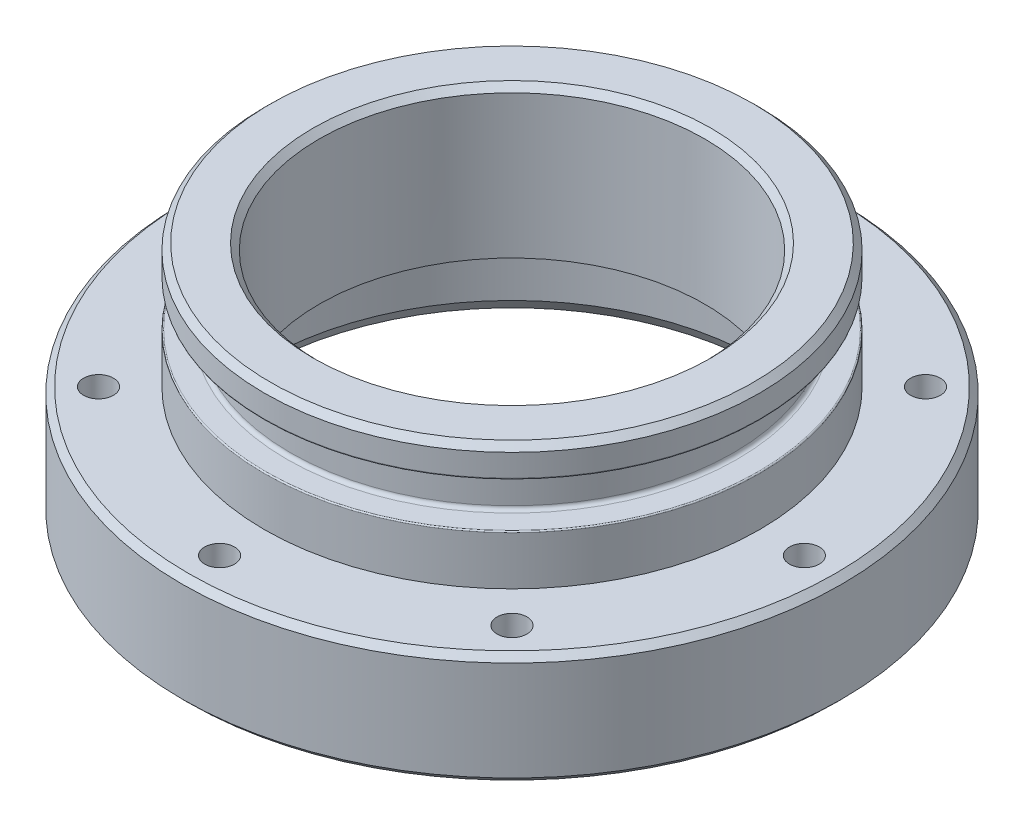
ISO-10303-21;
HEADER;
FILE_DESCRIPTION(('STEP AP214'),'2;1');
FILE_NAME('part.step','',(''),(''),'','','');
FILE_SCHEMA(('AUTOMOTIVE_DESIGN { 1 0 10303 214 1 1 1 1 }'));
ENDSEC;
DATA;
#1=APPLICATION_CONTEXT('core data for automotive mechanical design processes');
#2=APPLICATION_PROTOCOL_DEFINITION('international standard','automotive_design',2000,#1);
#3=PRODUCT_CONTEXT('',#1,'mechanical');
#4=PRODUCT('Part','Part','',(#3));
#5=PRODUCT_RELATED_PRODUCT_CATEGORY('part','',(#4));
#6=PRODUCT_DEFINITION_FORMATION('','',#4);
#7=PRODUCT_DEFINITION_CONTEXT('part definition',#1,'design');
#8=PRODUCT_DEFINITION('design','',#6,#7);
#9=PRODUCT_DEFINITION_SHAPE('','',#8);
#10=(LENGTH_UNIT() NAMED_UNIT(*) SI_UNIT(.MILLI.,.METRE.));
#11=(NAMED_UNIT(*) PLANE_ANGLE_UNIT() SI_UNIT($,.RADIAN.));
#12=(NAMED_UNIT(*) SI_UNIT($,.STERADIAN.) SOLID_ANGLE_UNIT());
#13=UNCERTAINTY_MEASURE_WITH_UNIT(LENGTH_MEASURE(1.E-05),#10,'distance_accuracy_value','');
#14=(GEOMETRIC_REPRESENTATION_CONTEXT(3) GLOBAL_UNCERTAINTY_ASSIGNED_CONTEXT((#13)) GLOBAL_UNIT_ASSIGNED_CONTEXT((#10,
#11,#12)) REPRESENTATION_CONTEXT('',''));
#15=CARTESIAN_POINT('',(0.,0.,0.));
#16=DIRECTION('',(0.,0.,1.));
#17=DIRECTION('',(1.,0.,0.));
#18=AXIS2_PLACEMENT_3D('',#15,#16,#17);
#19=CARTESIAN_POINT('',(20.5,0.,0.));
#20=DIRECTION('',(0.,1.,0.));
#21=DIRECTION('',(0.,0.,1.));
#22=AXIS2_PLACEMENT_3D('',#19,#20,#21);
#23=PLANE('',#22);
#24=CARTESIAN_POINT('',(-16.6170093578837,0.,16.6170093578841));
#25=DIRECTION('',(0.,-1.,0.));
#26=DIRECTION('',(0.,0.,-1.));
#27=AXIS2_PLACEMENT_3D('',#24,#25,#26);
#28=CIRCLE('',#27,2.19999999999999);
#29=CARTESIAN_POINT('',(-16.6170093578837,0.,14.4170093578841));
#30=VERTEX_POINT('',#29);
#31=EDGE_CURVE('E201',#30,#30,#28,.T.);
#32=ORIENTED_EDGE('',*,*,#31,.F.);
#33=EDGE_LOOP('',(#32));
#34=FACE_BOUND('',#33,.T.);
#35=CARTESIAN_POINT('',(-23.5,0.,2.46149434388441E-13));
#36=DIRECTION('',(0.,-1.,0.));
#37=DIRECTION('',(0.,0.,-1.));
#38=AXIS2_PLACEMENT_3D('',#35,#36,#37);
#39=CIRCLE('',#38,2.19999999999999);
#40=CARTESIAN_POINT('',(-23.5,0.,-2.19999999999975));
#41=VERTEX_POINT('',#40);
#42=EDGE_CURVE('E64',#41,#41,#39,.T.);
#43=ORIENTED_EDGE('',*,*,#42,.F.);
#44=EDGE_LOOP('',(#43));
#45=FACE_BOUND('',#44,.T.);
#46=CARTESIAN_POINT('',(-16.617009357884,0.,-16.6170093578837));
#47=DIRECTION('',(0.,-1.,0.));
#48=DIRECTION('',(0.,0.,-1.));
#49=AXIS2_PLACEMENT_3D('',#46,#47,#48);
#50=CIRCLE('',#49,2.19999999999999);
#51=CARTESIAN_POINT('',(-16.617009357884,0.,-18.8170093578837));
#52=VERTEX_POINT('',#51);
#53=EDGE_CURVE('E69',#52,#52,#50,.T.);
#54=ORIENTED_EDGE('',*,*,#53,.F.);
#55=EDGE_LOOP('',(#54));
#56=FACE_BOUND('',#55,.T.);
#57=CARTESIAN_POINT('',(0.,0.,-23.5));
#58=DIRECTION('',(0.,-1.,0.));
#59=DIRECTION('',(0.,0.,-1.));
#60=AXIS2_PLACEMENT_3D('',#57,#58,#59);
#61=CIRCLE('',#60,2.19999999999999);
#62=CARTESIAN_POINT('',(0.,0.,-25.7));
#63=VERTEX_POINT('',#62);
#64=EDGE_CURVE('E74',#63,#63,#61,.T.);
#65=ORIENTED_EDGE('',*,*,#64,.F.);
#66=EDGE_LOOP('',(#65));
#67=FACE_BOUND('',#66,.T.);
#68=CARTESIAN_POINT('',(16.6170093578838,0.,-16.617009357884));
#69=DIRECTION('',(0.,-1.,0.));
#70=DIRECTION('',(0.,0.,-1.));
#71=AXIS2_PLACEMENT_3D('',#68,#69,#70);
#72=CIRCLE('',#71,2.19999999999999);
#73=CARTESIAN_POINT('',(16.6170093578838,0.,-18.8170093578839));
#74=VERTEX_POINT('',#73);
#75=EDGE_CURVE('E79',#74,#74,#72,.T.);
#76=ORIENTED_EDGE('',*,*,#75,.F.);
#77=EDGE_LOOP('',(#76));
#78=FACE_BOUND('',#77,.T.);
#79=CARTESIAN_POINT('',(0.,0.,0.));
#80=DIRECTION('',(0.,1.,0.));
#81=DIRECTION('',(0.,0.,1.));
#82=AXIS2_PLACEMENT_3D('',#79,#80,#81);
#83=CIRCLE('',#82,20.5);
#84=CARTESIAN_POINT('',(0.,0.,20.5));
#85=VERTEX_POINT('',#84);
#86=EDGE_CURVE('E130',#85,#85,#83,.T.);
#87=ORIENTED_EDGE('',*,*,#86,.T.);
#88=EDGE_LOOP('',(#87));
#89=FACE_BOUND('',#88,.T.);
#90=CARTESIAN_POINT('',(0.,0.,23.5));
#91=DIRECTION('',(0.,-1.,0.));
#92=DIRECTION('',(0.,0.,-1.));
#93=AXIS2_PLACEMENT_3D('',#90,#91,#92);
#94=CIRCLE('',#93,2.19999999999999);
#95=CARTESIAN_POINT('',(0.,0.,21.3));
#96=VERTEX_POINT('',#95);
#97=EDGE_CURVE('E94',#96,#96,#94,.T.);
#98=ORIENTED_EDGE('',*,*,#97,.F.);
#99=EDGE_LOOP('',(#98));
#100=FACE_BOUND('',#99,.T.);
#101=CARTESIAN_POINT('',(0.,0.,0.));
#102=DIRECTION('',(0.,1.,0.));
#103=DIRECTION('',(0.,0.,1.));
#104=AXIS2_PLACEMENT_3D('',#101,#102,#103);
#105=CIRCLE('',#104,26.);
#106=CARTESIAN_POINT('',(0.,0.,26.));
#107=VERTEX_POINT('',#106);
#108=EDGE_CURVE('E60',#107,#107,#105,.F.);
#109=ORIENTED_EDGE('',*,*,#108,.T.);
#110=EDGE_LOOP('',(#109));
#111=FACE_BOUND('',#110,.T.);
#112=CARTESIAN_POINT('',(16.6170093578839,0.,16.6170093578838));
#113=DIRECTION('',(0.,-1.,0.));
#114=DIRECTION('',(0.,0.,-1.));
#115=AXIS2_PLACEMENT_3D('',#112,#113,#114);
#116=CIRCLE('',#115,2.19999999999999);
#117=CARTESIAN_POINT('',(16.6170093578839,0.,14.4170093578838));
#118=VERTEX_POINT('',#117);
#119=EDGE_CURVE('E89',#118,#118,#116,.T.);
#120=ORIENTED_EDGE('',*,*,#119,.F.);
#121=EDGE_LOOP('',(#120));
#122=FACE_BOUND('',#121,.T.);
#123=CARTESIAN_POINT('',(23.5,0.,0.));
#124=DIRECTION('',(0.,-1.,0.));
#125=DIRECTION('',(0.,0.,-1.));
#126=AXIS2_PLACEMENT_3D('',#123,#124,#125);
#127=CIRCLE('',#126,2.19999999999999);
#128=CARTESIAN_POINT('',(23.5,0.,-2.20000000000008));
#129=VERTEX_POINT('',#128);
#130=EDGE_CURVE('E84',#129,#129,#127,.T.);
#131=ORIENTED_EDGE('',*,*,#130,.F.);
#132=EDGE_LOOP('',(#131));
#133=FACE_BOUND('',#132,.T.);
#134=ADVANCED_FACE('F34',(#34,#45,#56,#67,#78,#89,#100,#111,#122,#133),#23,.F.);
#135=CARTESIAN_POINT('',(19.9,19.,0.));
#136=DIRECTION('',(0.,-1.,0.));
#137=DIRECTION('',(0.,0.,-1.));
#138=AXIS2_PLACEMENT_3D('',#135,#136,#137);
#139=PLANE('',#138);
#140=CARTESIAN_POINT('',(0.,19.,0.));
#141=DIRECTION('',(0.,-1.,0.));
#142=DIRECTION('',(0.,0.,-1.));
#143=AXIS2_PLACEMENT_3D('',#140,#141,#142);
#144=CIRCLE('',#143,16.);
#145=CARTESIAN_POINT('',(0.,19.,-16.));
#146=VERTEX_POINT('',#145);
#147=EDGE_CURVE('E110',#146,#146,#144,.T.);
#148=ORIENTED_EDGE('',*,*,#147,.T.);
#149=EDGE_LOOP('',(#148));
#150=FACE_BOUND('',#149,.T.);
#151=CARTESIAN_POINT('',(0.,19.,0.));
#152=DIRECTION('',(0.,-1.,0.));
#153=DIRECTION('',(0.,0.,-1.));
#154=AXIS2_PLACEMENT_3D('',#151,#152,#153);
#155=CIRCLE('',#154,19.4);
#156=CARTESIAN_POINT('',(0.,19.,-19.4));
#157=VERTEX_POINT('',#156);
#158=EDGE_CURVE('E113',#157,#157,#155,.F.);
#159=ORIENTED_EDGE('',*,*,#158,.T.);
#160=EDGE_LOOP('',(#159));
#161=FACE_BOUND('',#160,.T.);
#162=ADVANCED_FACE('F209',(#150,#161),#139,.F.);
#163=CARTESIAN_POINT('',(0.,15.0015133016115,0.));
#164=DIRECTION('',(0.,1.,0.));
#165=DIRECTION('',(0.,0.,1.));
#166=AXIS2_PLACEMENT_3D('',#163,#164,#165);
#167=CYLINDRICAL_SURFACE('',#166,15.5);
#168=CARTESIAN_POINT('',(0.,18.5,0.));
#169=DIRECTION('',(0.,-1.,0.));
#170=DIRECTION('',(0.,0.,-1.));
#171=AXIS2_PLACEMENT_3D('',#168,#169,#170);
#172=CIRCLE('',#171,15.5);
#173=CARTESIAN_POINT('',(0.,18.5,-15.5));
#174=VERTEX_POINT('',#173);
#175=EDGE_CURVE('E116',#174,#174,#172,.F.);
#176=ORIENTED_EDGE('',*,*,#175,.T.);
#177=EDGE_LOOP('',(#176));
#178=FACE_BOUND('',#177,.T.);
#179=CARTESIAN_POINT('',(0.,7.00000000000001,0.));
#180=DIRECTION('',(0.,1.,0.));
#181=DIRECTION('',(0.,0.,1.));
#182=AXIS2_PLACEMENT_3D('',#179,#180,#181);
#183=CIRCLE('',#182,15.5);
#184=CARTESIAN_POINT('',(0.,7.00000000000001,15.5));
#185=VERTEX_POINT('',#184);
#186=EDGE_CURVE('E119',#185,#185,#183,.T.);
#187=ORIENTED_EDGE('',*,*,#186,.F.);
#188=EDGE_LOOP('',(#187));
#189=FACE_BOUND('',#188,.T.);
#190=ADVANCED_FACE('F323',(#178,#189),#167,.F.);
#191=CARTESIAN_POINT('',(15.5,7.00000000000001,0.));
#192=DIRECTION('',(0.,1.,0.));
#193=DIRECTION('',(0.,0.,1.));
#194=AXIS2_PLACEMENT_3D('',#191,#192,#193);
#195=PLANE('',#194);
#196=CARTESIAN_POINT('',(0.,7.00000000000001,0.));
#197=DIRECTION('',(0.,1.,0.));
#198=DIRECTION('',(0.,0.,1.));
#199=AXIS2_PLACEMENT_3D('',#196,#197,#198);
#200=CIRCLE('',#199,19.7);
#201=CARTESIAN_POINT('',(0.,7.00000000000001,19.7));
#202=VERTEX_POINT('',#201);
#203=EDGE_CURVE('E10',#202,#202,#200,.F.);
#204=ORIENTED_EDGE('',*,*,#203,.T.);
#205=EDGE_LOOP('',(#204));
#206=FACE_BOUND('',#205,.T.);
#207=ORIENTED_EDGE('',*,*,#186,.T.);
#208=EDGE_LOOP('',(#207));
#209=FACE_BOUND('',#208,.T.);
#210=ADVANCED_FACE('F320',(#206,#209),#195,.F.);
#211=CARTESIAN_POINT('',(0.,15.0015133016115,0.));
#212=DIRECTION('',(0.,1.,0.));
#213=DIRECTION('',(0.,0.,1.));
#214=AXIS2_PLACEMENT_3D('',#211,#212,#213);
#215=CYLINDRICAL_SURFACE('',#214,20.);
#216=CARTESIAN_POINT('',(0.,6.70000000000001,0.));
#217=DIRECTION('',(0.,1.,0.));
#218=DIRECTION('',(0.,0.,1.));
#219=AXIS2_PLACEMENT_3D('',#216,#217,#218);
#220=CIRCLE('',#219,20.);
#221=CARTESIAN_POINT('',(0.,6.70000000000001,20.));
#222=VERTEX_POINT('',#221);
#223=EDGE_CURVE('E41',#222,#222,#220,.T.);
#224=ORIENTED_EDGE('',*,*,#223,.T.);
#225=EDGE_LOOP('',(#224));
#226=FACE_BOUND('',#225,.T.);
#227=CARTESIAN_POINT('',(0.,0.866025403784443,0.));
#228=DIRECTION('',(0.,1.,0.));
#229=DIRECTION('',(0.,0.,1.));
#230=AXIS2_PLACEMENT_3D('',#227,#228,#229);
#231=CIRCLE('',#230,20.);
#232=CARTESIAN_POINT('',(0.,0.866025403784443,20.));
#233=VERTEX_POINT('',#232);
#234=EDGE_CURVE('E127',#233,#233,#231,.T.);
#235=ORIENTED_EDGE('',*,*,#234,.F.);
#236=EDGE_LOOP('',(#235));
#237=FACE_BOUND('',#236,.T.);
#238=ADVANCED_FACE('F316',(#226,#237),#215,.F.);
#239=CARTESIAN_POINT('',(0.,0.866025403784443,0.));
#240=DIRECTION('',(0.,-1.,0.));
#241=DIRECTION('',(0.,0.,-1.));
#242=AXIS2_PLACEMENT_3D('',#239,#240,#241);
#243=CONICAL_SURFACE('',#242,20.,0.523598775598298);
#244=ORIENTED_EDGE('',*,*,#86,.F.);
#245=EDGE_LOOP('',(#244));
#246=FACE_BOUND('',#245,.T.);
#247=ORIENTED_EDGE('',*,*,#234,.T.);
#248=EDGE_LOOP('',(#247));
#249=FACE_BOUND('',#248,.T.);
#250=ADVANCED_FACE('F311',(#246,#249),#243,.F.);
#251=CARTESIAN_POINT('',(0.,15.0015133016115,0.));
#252=DIRECTION('',(0.,1.,0.));
#253=DIRECTION('',(0.,0.,1.));
#254=AXIS2_PLACEMENT_3D('',#251,#252,#253);
#255=CYLINDRICAL_SURFACE('',#254,26.5);
#256=CARTESIAN_POINT('',(0.,8.50000000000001,0.));
#257=DIRECTION('',(0.,-1.,0.));
#258=DIRECTION('',(0.,0.,-1.));
#259=AXIS2_PLACEMENT_3D('',#256,#257,#258);
#260=CIRCLE('',#259,26.5);
#261=CARTESIAN_POINT('',(0.,8.50000000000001,-26.5));
#262=VERTEX_POINT('',#261);
#263=EDGE_CURVE('E98',#262,#262,#260,.T.);
#264=ORIENTED_EDGE('',*,*,#263,.T.);
#265=EDGE_LOOP('',(#264));
#266=FACE_BOUND('',#265,.T.);
#267=CARTESIAN_POINT('',(0.,0.499999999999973,0.));
#268=DIRECTION('',(0.,1.,0.));
#269=DIRECTION('',(0.,0.,1.));
#270=AXIS2_PLACEMENT_3D('',#267,#268,#269);
#271=CIRCLE('',#270,26.5);
#272=CARTESIAN_POINT('',(0.,0.499999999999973,26.5));
#273=VERTEX_POINT('',#272);
#274=EDGE_CURVE('E101',#273,#273,#271,.T.);
#275=ORIENTED_EDGE('',*,*,#274,.T.);
#276=EDGE_LOOP('',(#275));
#277=FACE_BOUND('',#276,.T.);
#278=ADVANCED_FACE('F308',(#266,#277),#255,.T.);
#279=CARTESIAN_POINT('',(26.5,9.00000000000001,0.));
#280=DIRECTION('',(0.,-1.,0.));
#281=DIRECTION('',(0.,0.,-1.));
#282=AXIS2_PLACEMENT_3D('',#279,#280,#281);
#283=PLANE('',#282);
#284=CARTESIAN_POINT('',(-16.6170093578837,9.00000000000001,16.6170093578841));
#285=DIRECTION('',(0.,-1.,0.));
#286=DIRECTION('',(0.,0.,-1.));
#287=AXIS2_PLACEMENT_3D('',#284,#285,#286);
#288=CIRCLE('',#287,1.2);
#289=CARTESIAN_POINT('',(-16.6170093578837,9.00000000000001,15.4170093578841));
#290=VERTEX_POINT('',#289);
#291=EDGE_CURVE('E61',#290,#290,#288,.T.);
#292=ORIENTED_EDGE('',*,*,#291,.T.);
#293=EDGE_LOOP('',(#292));
#294=FACE_BOUND('',#293,.T.);
#295=CARTESIAN_POINT('',(-23.5,9.00000000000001,2.46149434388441E-13));
#296=DIRECTION('',(0.,-1.,0.));
#297=DIRECTION('',(0.,0.,-1.));
#298=AXIS2_PLACEMENT_3D('',#295,#296,#297);
#299=CIRCLE('',#298,1.2);
#300=CARTESIAN_POINT('',(-23.5,9.00000000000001,-1.19999999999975));
#301=VERTEX_POINT('',#300);
#302=EDGE_CURVE('E66',#301,#301,#299,.T.);
#303=ORIENTED_EDGE('',*,*,#302,.T.);
#304=EDGE_LOOP('',(#303));
#305=FACE_BOUND('',#304,.T.);
#306=CARTESIAN_POINT('',(-16.617009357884,9.00000000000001,-16.6170093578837));
#307=DIRECTION('',(0.,-1.,0.));
#308=DIRECTION('',(0.,0.,-1.));
#309=AXIS2_PLACEMENT_3D('',#306,#307,#308);
#310=CIRCLE('',#309,1.2);
#311=CARTESIAN_POINT('',(-16.617009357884,9.00000000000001,-17.8170093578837));
#312=VERTEX_POINT('',#311);
#313=EDGE_CURVE('E71',#312,#312,#310,.T.);
#314=ORIENTED_EDGE('',*,*,#313,.T.);
#315=EDGE_LOOP('',(#314));
#316=FACE_BOUND('',#315,.T.);
#317=CARTESIAN_POINT('',(0.,9.00000000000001,-23.5));
#318=DIRECTION('',(0.,-1.,0.));
#319=DIRECTION('',(0.,0.,-1.));
#320=AXIS2_PLACEMENT_3D('',#317,#318,#319);
#321=CIRCLE('',#320,1.2);
#322=CARTESIAN_POINT('',(0.,9.00000000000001,-24.7));
#323=VERTEX_POINT('',#322);
#324=EDGE_CURVE('E76',#323,#323,#321,.T.);
#325=ORIENTED_EDGE('',*,*,#324,.T.);
#326=EDGE_LOOP('',(#325));
#327=FACE_BOUND('',#326,.T.);
#328=CARTESIAN_POINT('',(16.6170093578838,9.00000000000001,-16.617009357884));
#329=DIRECTION('',(0.,-1.,0.));
#330=DIRECTION('',(0.,0.,-1.));
#331=AXIS2_PLACEMENT_3D('',#328,#329,#330);
#332=CIRCLE('',#331,1.2);
#333=CARTESIAN_POINT('',(16.6170093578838,9.00000000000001,-17.817009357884));
#334=VERTEX_POINT('',#333);
#335=EDGE_CURVE('E81',#334,#334,#332,.T.);
#336=ORIENTED_EDGE('',*,*,#335,.T.);
#337=EDGE_LOOP('',(#336));
#338=FACE_BOUND('',#337,.T.);
#339=CARTESIAN_POINT('',(23.5,9.00000000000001,0.));
#340=DIRECTION('',(0.,-1.,0.));
#341=DIRECTION('',(0.,0.,-1.));
#342=AXIS2_PLACEMENT_3D('',#339,#340,#341);
#343=CIRCLE('',#342,1.2);
#344=CARTESIAN_POINT('',(23.5,9.00000000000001,-1.20000000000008));
#345=VERTEX_POINT('',#344);
#346=EDGE_CURVE('E86',#345,#345,#343,.T.);
#347=ORIENTED_EDGE('',*,*,#346,.T.);
#348=EDGE_LOOP('',(#347));
#349=FACE_BOUND('',#348,.T.);
#350=CARTESIAN_POINT('',(16.6170093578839,9.00000000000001,16.6170093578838));
#351=DIRECTION('',(0.,-1.,0.));
#352=DIRECTION('',(0.,0.,-1.));
#353=AXIS2_PLACEMENT_3D('',#350,#351,#352);
#354=CIRCLE('',#353,1.2);
#355=CARTESIAN_POINT('',(16.6170093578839,9.00000000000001,15.4170093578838));
#356=VERTEX_POINT('',#355);
#357=EDGE_CURVE('E91',#356,#356,#354,.T.);
#358=ORIENTED_EDGE('',*,*,#357,.T.);
#359=EDGE_LOOP('',(#358));
#360=FACE_BOUND('',#359,.T.);
#361=CARTESIAN_POINT('',(0.,9.00000000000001,0.));
#362=DIRECTION('',(0.,-1.,0.));
#363=DIRECTION('',(0.,0.,-1.));
#364=AXIS2_PLACEMENT_3D('',#361,#362,#363);
#365=CIRCLE('',#364,26.);
#366=CARTESIAN_POINT('',(0.,9.00000000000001,-26.));
#367=VERTEX_POINT('',#366);
#368=EDGE_CURVE('E104',#367,#367,#365,.F.);
#369=ORIENTED_EDGE('',*,*,#368,.T.);
#370=EDGE_LOOP('',(#369));
#371=FACE_BOUND('',#370,.T.);
#372=CARTESIAN_POINT('',(0.,9.00000000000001,23.5));
#373=DIRECTION('',(0.,-1.,0.));
#374=DIRECTION('',(0.,0.,-1.));
#375=AXIS2_PLACEMENT_3D('',#372,#373,#374);
#376=CIRCLE('',#375,1.2);
#377=CARTESIAN_POINT('',(0.,9.00000000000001,22.3));
#378=VERTEX_POINT('',#377);
#379=EDGE_CURVE('E120',#378,#378,#376,.T.);
#380=ORIENTED_EDGE('',*,*,#379,.T.);
#381=EDGE_LOOP('',(#380));
#382=FACE_BOUND('',#381,.T.);
#383=CARTESIAN_POINT('',(0.,9.00000000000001,0.));
#384=DIRECTION('',(0.,1.,0.));
#385=DIRECTION('',(0.,0.,1.));
#386=AXIS2_PLACEMENT_3D('',#383,#384,#385);
#387=CIRCLE('',#386,19.9);
#388=CARTESIAN_POINT('',(0.,9.00000000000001,19.9));
#389=VERTEX_POINT('',#388);
#390=EDGE_CURVE('E133',#389,#389,#387,.T.);
#391=ORIENTED_EDGE('',*,*,#390,.F.);
#392=EDGE_LOOP('',(#391));
#393=FACE_BOUND('',#392,.T.);
#394=ADVANCED_FACE('F304',(#294,#305,#316,#327,#338,#349,#360,#371,#382,#393),#283,.F.);
#395=CARTESIAN_POINT('',(0.,15.0015133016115,0.));
#396=DIRECTION('',(0.,1.,0.));
#397=DIRECTION('',(0.,0.,1.));
#398=AXIS2_PLACEMENT_3D('',#395,#396,#397);
#399=CYLINDRICAL_SURFACE('',#398,19.9);
#400=CARTESIAN_POINT('',(0.,12.9,0.));
#401=DIRECTION('',(0.,-1.,0.));
#402=DIRECTION('',(0.,0.,-1.));
#403=AXIS2_PLACEMENT_3D('',#400,#401,#402);
#404=CIRCLE('',#403,19.9);
#405=CARTESIAN_POINT('',(0.,12.9,-19.9));
#406=VERTEX_POINT('',#405);
#407=EDGE_CURVE('E45',#406,#406,#404,.T.);
#408=ORIENTED_EDGE('',*,*,#407,.T.);
#409=EDGE_LOOP('',(#408));
#410=FACE_BOUND('',#409,.T.);
#411=ORIENTED_EDGE('',*,*,#390,.T.);
#412=EDGE_LOOP('',(#411));
#413=FACE_BOUND('',#412,.T.);
#414=ADVANCED_FACE('F300',(#410,#413),#399,.T.);
#415=CARTESIAN_POINT('',(19.9,13.,0.));
#416=DIRECTION('',(0.,-1.,0.));
#417=DIRECTION('',(0.,0.,-1.));
#418=AXIS2_PLACEMENT_3D('',#415,#416,#417);
#419=PLANE('',#418);
#420=CARTESIAN_POINT('',(0.,13.,0.));
#421=DIRECTION('',(0.,-1.,0.));
#422=DIRECTION('',(0.,0.,-1.));
#423=AXIS2_PLACEMENT_3D('',#420,#421,#422);
#424=CIRCLE('',#423,19.8);
#425=CARTESIAN_POINT('',(0.,13.,-19.8));
#426=VERTEX_POINT('',#425);
#427=EDGE_CURVE('E49',#426,#426,#424,.F.);
#428=ORIENTED_EDGE('',*,*,#427,.T.);
#429=EDGE_LOOP('',(#428));
#430=FACE_BOUND('',#429,.T.);
#431=CARTESIAN_POINT('',(0.,13.,0.));
#432=DIRECTION('',(0.,1.,0.));
#433=DIRECTION('',(0.,0.,1.));
#434=AXIS2_PLACEMENT_3D('',#431,#432,#433);
#435=CIRCLE('',#434,18.1);
#436=CARTESIAN_POINT('',(0.,13.,18.1));
#437=VERTEX_POINT('',#436);
#438=EDGE_CURVE('E136',#437,#437,#435,.T.);
#439=ORIENTED_EDGE('',*,*,#438,.F.);
#440=EDGE_LOOP('',(#439));
#441=FACE_BOUND('',#440,.T.);
#442=ADVANCED_FACE('F296',(#430,#441),#419,.F.);
#443=CARTESIAN_POINT('',(0.,13.3,0.));
#444=DIRECTION('',(0.,1.,0.));
#445=DIRECTION('',(0.,0.,1.));
#446=AXIS2_PLACEMENT_3D('',#443,#444,#445);
#447=TOROIDAL_SURFACE('',#446,18.1,0.300000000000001);
#448=CARTESIAN_POINT('',(0.,13.3,0.));
#449=DIRECTION('',(0.,1.,0.));
#450=DIRECTION('',(0.,0.,1.));
#451=AXIS2_PLACEMENT_3D('',#448,#449,#450);
#452=CIRCLE('',#451,17.8);
#453=CARTESIAN_POINT('',(0.,13.3,17.8));
#454=VERTEX_POINT('',#453);
#455=EDGE_CURVE('E139',#454,#454,#452,.T.);
#456=ORIENTED_EDGE('',*,*,#455,.F.);
#457=EDGE_LOOP('',(#456));
#458=FACE_BOUND('',#457,.T.);
#459=ORIENTED_EDGE('',*,*,#438,.T.);
#460=EDGE_LOOP('',(#459));
#461=FACE_BOUND('',#460,.T.);
#462=ADVANCED_FACE('F292',(#458,#461),#447,.F.);
#463=CARTESIAN_POINT('',(0.,15.0015133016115,0.));
#464=DIRECTION('',(0.,1.,0.));
#465=DIRECTION('',(0.,0.,1.));
#466=AXIS2_PLACEMENT_3D('',#463,#464,#465);
#467=CYLINDRICAL_SURFACE('',#466,17.8);
#468=CARTESIAN_POINT('',(0.,16.3,0.));
#469=DIRECTION('',(0.,1.,0.));
#470=DIRECTION('',(0.,0.,1.));
#471=AXIS2_PLACEMENT_3D('',#468,#469,#470);
#472=CIRCLE('',#471,17.8);
#473=CARTESIAN_POINT('',(0.,16.3,17.8));
#474=VERTEX_POINT('',#473);
#475=EDGE_CURVE('E142',#474,#474,#472,.T.);
#476=ORIENTED_EDGE('',*,*,#475,.F.);
#477=EDGE_LOOP('',(#476));
#478=FACE_BOUND('',#477,.T.);
#479=ORIENTED_EDGE('',*,*,#455,.T.);
#480=EDGE_LOOP('',(#479));
#481=FACE_BOUND('',#480,.T.);
#482=ADVANCED_FACE('F288',(#478,#481),#467,.T.);
#483=CARTESIAN_POINT('',(0.,16.3,0.));
#484=DIRECTION('',(0.,1.,0.));
#485=DIRECTION('',(0.,0.,1.));
#486=AXIS2_PLACEMENT_3D('',#483,#484,#485);
#487=TOROIDAL_SURFACE('',#486,18.1,0.3);
#488=CARTESIAN_POINT('',(0.,16.6,0.));
#489=DIRECTION('',(0.,1.,0.));
#490=DIRECTION('',(0.,0.,1.));
#491=AXIS2_PLACEMENT_3D('',#488,#489,#490);
#492=CIRCLE('',#491,18.1);
#493=CARTESIAN_POINT('',(0.,16.6,18.1));
#494=VERTEX_POINT('',#493);
#495=EDGE_CURVE('E123',#494,#494,#492,.T.);
#496=ORIENTED_EDGE('',*,*,#495,.F.);
#497=EDGE_LOOP('',(#496));
#498=FACE_BOUND('',#497,.T.);
#499=ORIENTED_EDGE('',*,*,#475,.T.);
#500=EDGE_LOOP('',(#499));
#501=FACE_BOUND('',#500,.T.);
#502=ADVANCED_FACE('F284',(#498,#501),#487,.F.);
#503=CARTESIAN_POINT('',(18.1,16.6,0.));
#504=DIRECTION('',(0.,1.,0.));
#505=DIRECTION('',(0.,0.,1.));
#506=AXIS2_PLACEMENT_3D('',#503,#504,#505);
#507=PLANE('',#506);
#508=CARTESIAN_POINT('',(0.,16.6,0.));
#509=DIRECTION('',(0.,1.,0.));
#510=DIRECTION('',(0.,0.,1.));
#511=AXIS2_PLACEMENT_3D('',#508,#509,#510);
#512=CIRCLE('',#511,19.8);
#513=CARTESIAN_POINT('',(0.,16.6,19.8));
#514=VERTEX_POINT('',#513);
#515=EDGE_CURVE('E54',#514,#514,#512,.F.);
#516=ORIENTED_EDGE('',*,*,#515,.T.);
#517=EDGE_LOOP('',(#516));
#518=FACE_BOUND('',#517,.T.);
#519=ORIENTED_EDGE('',*,*,#495,.T.);
#520=EDGE_LOOP('',(#519));
#521=FACE_BOUND('',#520,.T.);
#522=ADVANCED_FACE('F280',(#518,#521),#507,.F.);
#523=CARTESIAN_POINT('',(0.,15.0015133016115,0.));
#524=DIRECTION('',(0.,1.,0.));
#525=DIRECTION('',(0.,0.,1.));
#526=AXIS2_PLACEMENT_3D('',#523,#524,#525);
#527=CYLINDRICAL_SURFACE('',#526,19.9);
#528=CARTESIAN_POINT('',(0.,16.7,0.));
#529=DIRECTION('',(0.,1.,0.));
#530=DIRECTION('',(0.,0.,1.));
#531=AXIS2_PLACEMENT_3D('',#528,#529,#530);
#532=CIRCLE('',#531,19.9);
#533=CARTESIAN_POINT('',(0.,16.7,19.9));
#534=VERTEX_POINT('',#533);
#535=EDGE_CURVE('E57',#534,#534,#532,.T.);
#536=ORIENTED_EDGE('',*,*,#535,.T.);
#537=EDGE_LOOP('',(#536));
#538=FACE_BOUND('',#537,.T.);
#539=CARTESIAN_POINT('',(0.,18.5,0.));
#540=DIRECTION('',(0.,-1.,0.));
#541=DIRECTION('',(0.,0.,-1.));
#542=AXIS2_PLACEMENT_3D('',#539,#540,#541);
#543=CIRCLE('',#542,19.9);
#544=CARTESIAN_POINT('',(0.,18.5,-19.9));
#545=VERTEX_POINT('',#544);
#546=EDGE_CURVE('E107',#545,#545,#543,.T.);
#547=ORIENTED_EDGE('',*,*,#546,.T.);
#548=EDGE_LOOP('',(#547));
#549=FACE_BOUND('',#548,.T.);
#550=ADVANCED_FACE('F276',(#538,#549),#527,.T.);
#551=CARTESIAN_POINT('',(0.,0.,23.5));
#552=DIRECTION('',(0.,-1.,0.));
#553=DIRECTION('',(0.,0.,-1.));
#554=AXIS2_PLACEMENT_3D('',#551,#552,#553);
#555=CYLINDRICAL_SURFACE('',#554,1.2);
#556=CARTESIAN_POINT('',(0.,2.40000000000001,23.5));
#557=DIRECTION('',(0.,-1.,0.));
#558=DIRECTION('',(0.,0.,-1.));
#559=AXIS2_PLACEMENT_3D('',#556,#557,#558);
#560=CIRCLE('',#559,1.2);
#561=CARTESIAN_POINT('',(0.,2.40000000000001,22.3));
#562=VERTEX_POINT('',#561);
#563=EDGE_CURVE('E124',#562,#562,#560,.T.);
#564=ORIENTED_EDGE('',*,*,#563,.T.);
#565=EDGE_LOOP('',(#564));
#566=FACE_BOUND('',#565,.T.);
#567=ORIENTED_EDGE('',*,*,#379,.F.);
#568=EDGE_LOOP('',(#567));
#569=FACE_BOUND('',#568,.T.);
#570=ADVANCED_FACE('F272',(#566,#569),#555,.F.);
#571=CARTESIAN_POINT('',(1.2,2.40000000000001,23.5));
#572=DIRECTION('',(0.,1.,0.));
#573=DIRECTION('',(0.,0.,1.));
#574=AXIS2_PLACEMENT_3D('',#571,#572,#573);
#575=PLANE('',#574);
#576=ORIENTED_EDGE('',*,*,#563,.F.);
#577=EDGE_LOOP('',(#576));
#578=FACE_BOUND('',#577,.T.);
#579=CARTESIAN_POINT('',(0.,2.40000000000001,23.5));
#580=DIRECTION('',(0.,-1.,0.));
#581=DIRECTION('',(0.,0.,-1.));
#582=AXIS2_PLACEMENT_3D('',#579,#580,#581);
#583=CIRCLE('',#582,2.2);
#584=CARTESIAN_POINT('',(0.,2.40000000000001,21.3));
#585=VERTEX_POINT('',#584);
#586=EDGE_CURVE('E149',#585,#585,#583,.T.);
#587=ORIENTED_EDGE('',*,*,#586,.T.);
#588=EDGE_LOOP('',(#587));
#589=FACE_BOUND('',#588,.T.);
#590=ADVANCED_FACE('F268',(#578,#589),#575,.F.);
#591=CARTESIAN_POINT('',(0.,0.,23.5));
#592=DIRECTION('',(0.,-1.,0.));
#593=DIRECTION('',(0.,0.,-1.));
#594=AXIS2_PLACEMENT_3D('',#591,#592,#593);
#595=CYLINDRICAL_SURFACE('',#594,2.19999999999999);
#596=ORIENTED_EDGE('',*,*,#586,.F.);
#597=EDGE_LOOP('',(#596));
#598=FACE_BOUND('',#597,.T.);
#599=ORIENTED_EDGE('',*,*,#97,.T.);
#600=EDGE_LOOP('',(#599));
#601=FACE_BOUND('',#600,.T.);
#602=ADVANCED_FACE('F264',(#598,#601),#595,.F.);
#603=CARTESIAN_POINT('',(0.,18.5,0.));
#604=DIRECTION('',(0.,1.,0.));
#605=DIRECTION('',(0.,0.,1.));
#606=AXIS2_PLACEMENT_3D('',#603,#604,#605);
#607=CONICAL_SURFACE('',#606,15.5,0.78539816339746);
#608=ORIENTED_EDGE('',*,*,#147,.F.);
#609=EDGE_LOOP('',(#608));
#610=FACE_BOUND('',#609,.T.);
#611=ORIENTED_EDGE('',*,*,#175,.F.);
#612=EDGE_LOOP('',(#611));
#613=FACE_BOUND('',#612,.T.);
#614=ADVANCED_FACE('F267',(#610,#613),#607,.F.);
#615=CARTESIAN_POINT('',(0.,19.,0.));
#616=DIRECTION('',(0.,-1.,0.));
#617=DIRECTION('',(0.,0.,-1.));
#618=AXIS2_PLACEMENT_3D('',#615,#616,#617);
#619=CONICAL_SURFACE('',#618,19.4,0.785398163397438);
#620=ORIENTED_EDGE('',*,*,#546,.F.);
#621=EDGE_LOOP('',(#620));
#622=FACE_BOUND('',#621,.T.);
#623=ORIENTED_EDGE('',*,*,#158,.F.);
#624=EDGE_LOOP('',(#623));
#625=FACE_BOUND('',#624,.T.);
#626=ADVANCED_FACE('F332',(#622,#625),#619,.T.);
#627=CARTESIAN_POINT('',(0.,9.00000000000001,0.));
#628=DIRECTION('',(0.,-1.,0.));
#629=DIRECTION('',(0.,0.,-1.));
#630=AXIS2_PLACEMENT_3D('',#627,#628,#629);
#631=CONICAL_SURFACE('',#630,26.,0.785398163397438);
#632=ORIENTED_EDGE('',*,*,#263,.F.);
#633=EDGE_LOOP('',(#632));
#634=FACE_BOUND('',#633,.T.);
#635=ORIENTED_EDGE('',*,*,#368,.F.);
#636=EDGE_LOOP('',(#635));
#637=FACE_BOUND('',#636,.T.);
#638=ADVANCED_FACE('F336',(#634,#637),#631,.T.);
#639=CARTESIAN_POINT('',(0.,0.499999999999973,0.));
#640=DIRECTION('',(0.,1.,0.));
#641=DIRECTION('',(0.,0.,1.));
#642=AXIS2_PLACEMENT_3D('',#639,#640,#641);
#643=CONICAL_SURFACE('',#642,26.5,0.785398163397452);
#644=ORIENTED_EDGE('',*,*,#108,.F.);
#645=EDGE_LOOP('',(#644));
#646=FACE_BOUND('',#645,.T.);
#647=ORIENTED_EDGE('',*,*,#274,.F.);
#648=EDGE_LOOP('',(#647));
#649=FACE_BOUND('',#648,.T.);
#650=ADVANCED_FACE('F262',(#646,#649),#643,.T.);
#651=CARTESIAN_POINT('',(16.6170093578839,0.,16.6170093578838));
#652=DIRECTION('',(0.,-1.,0.));
#653=DIRECTION('',(0.,0.,-1.));
#654=AXIS2_PLACEMENT_3D('',#651,#652,#653);
#655=CYLINDRICAL_SURFACE('',#654,1.2);
#656=CARTESIAN_POINT('',(16.6170093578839,2.40000000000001,16.6170093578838));
#657=DIRECTION('',(0.,-1.,0.));
#658=DIRECTION('',(0.,0.,-1.));
#659=AXIS2_PLACEMENT_3D('',#656,#657,#658);
#660=CIRCLE('',#659,1.2);
#661=CARTESIAN_POINT('',(16.6170093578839,2.40000000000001,15.4170093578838));
#662=VERTEX_POINT('',#661);
#663=EDGE_CURVE('E95',#662,#662,#660,.T.);
#664=ORIENTED_EDGE('',*,*,#663,.T.);
#665=EDGE_LOOP('',(#664));
#666=FACE_BOUND('',#665,.T.);
#667=ORIENTED_EDGE('',*,*,#357,.F.);
#668=EDGE_LOOP('',(#667));
#669=FACE_BOUND('',#668,.T.);
#670=ADVANCED_FACE('F258',(#666,#669),#655,.F.);
#671=CARTESIAN_POINT('',(17.8170093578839,2.40000000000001,16.6170093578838));
#672=DIRECTION('',(0.,1.,0.));
#673=DIRECTION('',(0.,0.,1.));
#674=AXIS2_PLACEMENT_3D('',#671,#672,#673);
#675=PLANE('',#674);
#676=ORIENTED_EDGE('',*,*,#663,.F.);
#677=EDGE_LOOP('',(#676));
#678=FACE_BOUND('',#677,.T.);
#679=CARTESIAN_POINT('',(16.6170093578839,2.40000000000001,16.6170093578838));
#680=DIRECTION('',(0.,-1.,0.));
#681=DIRECTION('',(0.,0.,-1.));
#682=AXIS2_PLACEMENT_3D('',#679,#680,#681);
#683=CIRCLE('',#682,2.2);
#684=CARTESIAN_POINT('',(16.6170093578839,2.40000000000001,14.4170093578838));
#685=VERTEX_POINT('',#684);
#686=EDGE_CURVE('E156',#685,#685,#683,.T.);
#687=ORIENTED_EDGE('',*,*,#686,.T.);
#688=EDGE_LOOP('',(#687));
#689=FACE_BOUND('',#688,.T.);
#690=ADVANCED_FACE('F254',(#678,#689),#675,.F.);
#691=CARTESIAN_POINT('',(16.6170093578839,0.,16.6170093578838));
#692=DIRECTION('',(0.,-1.,0.));
#693=DIRECTION('',(0.,0.,-1.));
#694=AXIS2_PLACEMENT_3D('',#691,#692,#693);
#695=CYLINDRICAL_SURFACE('',#694,2.2);
#696=ORIENTED_EDGE('',*,*,#686,.F.);
#697=EDGE_LOOP('',(#696));
#698=FACE_BOUND('',#697,.T.);
#699=ORIENTED_EDGE('',*,*,#119,.T.);
#700=EDGE_LOOP('',(#699));
#701=FACE_BOUND('',#700,.T.);
#702=ADVANCED_FACE('F250',(#698,#701),#695,.F.);
#703=CARTESIAN_POINT('',(23.5,0.,0.));
#704=DIRECTION('',(0.,-1.,0.));
#705=DIRECTION('',(0.,0.,-1.));
#706=AXIS2_PLACEMENT_3D('',#703,#704,#705);
#707=CYLINDRICAL_SURFACE('',#706,1.2);
#708=CARTESIAN_POINT('',(23.5,2.40000000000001,0.));
#709=DIRECTION('',(0.,-1.,0.));
#710=DIRECTION('',(0.,0.,-1.));
#711=AXIS2_PLACEMENT_3D('',#708,#709,#710);
#712=CIRCLE('',#711,1.2);
#713=CARTESIAN_POINT('',(23.5,2.40000000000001,-1.20000000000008));
#714=VERTEX_POINT('',#713);
#715=EDGE_CURVE('E90',#714,#714,#712,.T.);
#716=ORIENTED_EDGE('',*,*,#715,.T.);
#717=EDGE_LOOP('',(#716));
#718=FACE_BOUND('',#717,.T.);
#719=ORIENTED_EDGE('',*,*,#346,.F.);
#720=EDGE_LOOP('',(#719));
#721=FACE_BOUND('',#720,.T.);
#722=ADVANCED_FACE('F242',(#718,#721),#707,.F.);
#723=CARTESIAN_POINT('',(24.7,2.40000000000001,0.));
#724=DIRECTION('',(0.,1.,0.));
#725=DIRECTION('',(0.,0.,1.));
#726=AXIS2_PLACEMENT_3D('',#723,#724,#725);
#727=PLANE('',#726);
#728=ORIENTED_EDGE('',*,*,#715,.F.);
#729=EDGE_LOOP('',(#728));
#730=FACE_BOUND('',#729,.T.);
#731=CARTESIAN_POINT('',(23.5,2.40000000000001,0.));
#732=DIRECTION('',(0.,-1.,0.));
#733=DIRECTION('',(0.,0.,-1.));
#734=AXIS2_PLACEMENT_3D('',#731,#732,#733);
#735=CIRCLE('',#734,2.2);
#736=CARTESIAN_POINT('',(23.5,2.40000000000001,-2.20000000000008));
#737=VERTEX_POINT('',#736);
#738=EDGE_CURVE('E163',#737,#737,#735,.T.);
#739=ORIENTED_EDGE('',*,*,#738,.T.);
#740=EDGE_LOOP('',(#739));
#741=FACE_BOUND('',#740,.T.);
#742=ADVANCED_FACE('F232',(#730,#741),#727,.F.);
#743=CARTESIAN_POINT('',(23.5,0.,0.));
#744=DIRECTION('',(0.,-1.,0.));
#745=DIRECTION('',(0.,0.,-1.));
#746=AXIS2_PLACEMENT_3D('',#743,#744,#745);
#747=CYLINDRICAL_SURFACE('',#746,2.2);
#748=ORIENTED_EDGE('',*,*,#738,.F.);
#749=EDGE_LOOP('',(#748));
#750=FACE_BOUND('',#749,.T.);
#751=ORIENTED_EDGE('',*,*,#130,.T.);
#752=EDGE_LOOP('',(#751));
#753=FACE_BOUND('',#752,.T.);
#754=ADVANCED_FACE('F229',(#750,#753),#747,.F.);
#755=CARTESIAN_POINT('',(16.6170093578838,0.,-16.617009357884));
#756=DIRECTION('',(0.,-1.,0.));
#757=DIRECTION('',(0.,0.,-1.));
#758=AXIS2_PLACEMENT_3D('',#755,#756,#757);
#759=CYLINDRICAL_SURFACE('',#758,1.2);
#760=CARTESIAN_POINT('',(16.6170093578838,2.40000000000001,-16.617009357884));
#761=DIRECTION('',(0.,-1.,0.));
#762=DIRECTION('',(0.,0.,-1.));
#763=AXIS2_PLACEMENT_3D('',#760,#761,#762);
#764=CIRCLE('',#763,1.2);
#765=CARTESIAN_POINT('',(16.6170093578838,2.40000000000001,-17.817009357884));
#766=VERTEX_POINT('',#765);
#767=EDGE_CURVE('E85',#766,#766,#764,.T.);
#768=ORIENTED_EDGE('',*,*,#767,.T.);
#769=EDGE_LOOP('',(#768));
#770=FACE_BOUND('',#769,.T.);
#771=ORIENTED_EDGE('',*,*,#335,.F.);
#772=EDGE_LOOP('',(#771));
#773=FACE_BOUND('',#772,.T.);
#774=ADVANCED_FACE('F231',(#770,#773),#759,.F.);
#775=CARTESIAN_POINT('',(17.8170093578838,2.40000000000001,-16.617009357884));
#776=DIRECTION('',(0.,1.,0.));
#777=DIRECTION('',(0.,0.,1.));
#778=AXIS2_PLACEMENT_3D('',#775,#776,#777);
#779=PLANE('',#778);
#780=ORIENTED_EDGE('',*,*,#767,.F.);
#781=EDGE_LOOP('',(#780));
#782=FACE_BOUND('',#781,.T.);
#783=CARTESIAN_POINT('',(16.6170093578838,2.40000000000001,-16.617009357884));
#784=DIRECTION('',(0.,-1.,0.));
#785=DIRECTION('',(0.,0.,-1.));
#786=AXIS2_PLACEMENT_3D('',#783,#784,#785);
#787=CIRCLE('',#786,2.2);
#788=CARTESIAN_POINT('',(16.6170093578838,2.40000000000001,-18.817009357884));
#789=VERTEX_POINT('',#788);
#790=EDGE_CURVE('E170',#789,#789,#787,.T.);
#791=ORIENTED_EDGE('',*,*,#790,.T.);
#792=EDGE_LOOP('',(#791));
#793=FACE_BOUND('',#792,.T.);
#794=ADVANCED_FACE('F239',(#782,#793),#779,.F.);
#795=CARTESIAN_POINT('',(16.6170093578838,0.,-16.617009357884));
#796=DIRECTION('',(0.,-1.,0.));
#797=DIRECTION('',(0.,0.,-1.));
#798=AXIS2_PLACEMENT_3D('',#795,#796,#797);
#799=CYLINDRICAL_SURFACE('',#798,2.2);
#800=ORIENTED_EDGE('',*,*,#790,.F.);
#801=EDGE_LOOP('',(#800));
#802=FACE_BOUND('',#801,.T.);
#803=ORIENTED_EDGE('',*,*,#75,.T.);
#804=EDGE_LOOP('',(#803));
#805=FACE_BOUND('',#804,.T.);
#806=ADVANCED_FACE('F467',(#802,#805),#799,.F.);
#807=CARTESIAN_POINT('',(0.,0.,-23.5));
#808=DIRECTION('',(0.,-1.,0.));
#809=DIRECTION('',(0.,0.,-1.));
#810=AXIS2_PLACEMENT_3D('',#807,#808,#809);
#811=CYLINDRICAL_SURFACE('',#810,1.2);
#812=CARTESIAN_POINT('',(0.,2.40000000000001,-23.5));
#813=DIRECTION('',(0.,-1.,0.));
#814=DIRECTION('',(0.,0.,-1.));
#815=AXIS2_PLACEMENT_3D('',#812,#813,#814);
#816=CIRCLE('',#815,1.2);
#817=CARTESIAN_POINT('',(0.,2.40000000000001,-24.7));
#818=VERTEX_POINT('',#817);
#819=EDGE_CURVE('E80',#818,#818,#816,.T.);
#820=ORIENTED_EDGE('',*,*,#819,.T.);
#821=EDGE_LOOP('',(#820));
#822=FACE_BOUND('',#821,.T.);
#823=ORIENTED_EDGE('',*,*,#324,.F.);
#824=EDGE_LOOP('',(#823));
#825=FACE_BOUND('',#824,.T.);
#826=ADVANCED_FACE('F459',(#822,#825),#811,.F.);
#827=CARTESIAN_POINT('',(1.2,2.40000000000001,-23.5));
#828=DIRECTION('',(0.,1.,0.));
#829=DIRECTION('',(0.,0.,1.));
#830=AXIS2_PLACEMENT_3D('',#827,#828,#829);
#831=PLANE('',#830);
#832=ORIENTED_EDGE('',*,*,#819,.F.);
#833=EDGE_LOOP('',(#832));
#834=FACE_BOUND('',#833,.T.);
#835=CARTESIAN_POINT('',(0.,2.40000000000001,-23.5));
#836=DIRECTION('',(0.,-1.,0.));
#837=DIRECTION('',(0.,0.,-1.));
#838=AXIS2_PLACEMENT_3D('',#835,#836,#837);
#839=CIRCLE('',#838,2.2);
#840=CARTESIAN_POINT('',(0.,2.40000000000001,-25.7));
#841=VERTEX_POINT('',#840);
#842=EDGE_CURVE('E177',#841,#841,#839,.T.);
#843=ORIENTED_EDGE('',*,*,#842,.T.);
#844=EDGE_LOOP('',(#843));
#845=FACE_BOUND('',#844,.T.);
#846=ADVANCED_FACE('F451',(#834,#845),#831,.F.);
#847=CARTESIAN_POINT('',(0.,0.,-23.5));
#848=DIRECTION('',(0.,-1.,0.));
#849=DIRECTION('',(0.,0.,-1.));
#850=AXIS2_PLACEMENT_3D('',#847,#848,#849);
#851=CYLINDRICAL_SURFACE('',#850,2.19999999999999);
#852=ORIENTED_EDGE('',*,*,#842,.F.);
#853=EDGE_LOOP('',(#852));
#854=FACE_BOUND('',#853,.T.);
#855=ORIENTED_EDGE('',*,*,#64,.T.);
#856=EDGE_LOOP('',(#855));
#857=FACE_BOUND('',#856,.T.);
#858=ADVANCED_FACE('F443',(#854,#857),#851,.F.);
#859=CARTESIAN_POINT('',(-16.617009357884,0.,-16.6170093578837));
#860=DIRECTION('',(0.,-1.,0.));
#861=DIRECTION('',(0.,0.,-1.));
#862=AXIS2_PLACEMENT_3D('',#859,#860,#861);
#863=CYLINDRICAL_SURFACE('',#862,1.2);
#864=CARTESIAN_POINT('',(-16.617009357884,2.40000000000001,-16.6170093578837));
#865=DIRECTION('',(0.,-1.,0.));
#866=DIRECTION('',(0.,0.,-1.));
#867=AXIS2_PLACEMENT_3D('',#864,#865,#866);
#868=CIRCLE('',#867,1.2);
#869=CARTESIAN_POINT('',(-16.617009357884,2.40000000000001,-17.8170093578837));
#870=VERTEX_POINT('',#869);
#871=EDGE_CURVE('E75',#870,#870,#868,.T.);
#872=ORIENTED_EDGE('',*,*,#871,.T.);
#873=EDGE_LOOP('',(#872));
#874=FACE_BOUND('',#873,.T.);
#875=ORIENTED_EDGE('',*,*,#313,.F.);
#876=EDGE_LOOP('',(#875));
#877=FACE_BOUND('',#876,.T.);
#878=ADVANCED_FACE('F435',(#874,#877),#863,.F.);
#879=CARTESIAN_POINT('',(-15.417009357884,2.40000000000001,-16.6170093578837));
#880=DIRECTION('',(0.,1.,0.));
#881=DIRECTION('',(0.,0.,1.));
#882=AXIS2_PLACEMENT_3D('',#879,#880,#881);
#883=PLANE('',#882);
#884=ORIENTED_EDGE('',*,*,#871,.F.);
#885=EDGE_LOOP('',(#884));
#886=FACE_BOUND('',#885,.T.);
#887=CARTESIAN_POINT('',(-16.617009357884,2.40000000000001,-16.6170093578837));
#888=DIRECTION('',(0.,-1.,0.));
#889=DIRECTION('',(0.,0.,-1.));
#890=AXIS2_PLACEMENT_3D('',#887,#888,#889);
#891=CIRCLE('',#890,2.2);
#892=CARTESIAN_POINT('',(-16.617009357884,2.40000000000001,-18.8170093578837));
#893=VERTEX_POINT('',#892);
#894=EDGE_CURVE('E184',#893,#893,#891,.T.);
#895=ORIENTED_EDGE('',*,*,#894,.T.);
#896=EDGE_LOOP('',(#895));
#897=FACE_BOUND('',#896,.T.);
#898=ADVANCED_FACE('F427',(#886,#897),#883,.F.);
#899=CARTESIAN_POINT('',(-16.617009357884,0.,-16.6170093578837));
#900=DIRECTION('',(0.,-1.,0.));
#901=DIRECTION('',(0.,0.,-1.));
#902=AXIS2_PLACEMENT_3D('',#899,#900,#901);
#903=CYLINDRICAL_SURFACE('',#902,2.2);
#904=ORIENTED_EDGE('',*,*,#894,.F.);
#905=EDGE_LOOP('',(#904));
#906=FACE_BOUND('',#905,.T.);
#907=ORIENTED_EDGE('',*,*,#53,.T.);
#908=EDGE_LOOP('',(#907));
#909=FACE_BOUND('',#908,.T.);
#910=ADVANCED_FACE('F419',(#906,#909),#903,.F.);
#911=CARTESIAN_POINT('',(-23.5,0.,2.46149434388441E-13));
#912=DIRECTION('',(0.,-1.,0.));
#913=DIRECTION('',(0.,0.,-1.));
#914=AXIS2_PLACEMENT_3D('',#911,#912,#913);
#915=CYLINDRICAL_SURFACE('',#914,1.2);
#916=CARTESIAN_POINT('',(-23.5,2.40000000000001,2.46149434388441E-13));
#917=DIRECTION('',(0.,-1.,0.));
#918=DIRECTION('',(0.,0.,-1.));
#919=AXIS2_PLACEMENT_3D('',#916,#917,#918);
#920=CIRCLE('',#919,1.2);
#921=CARTESIAN_POINT('',(-23.5,2.40000000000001,-1.19999999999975));
#922=VERTEX_POINT('',#921);
#923=EDGE_CURVE('E70',#922,#922,#920,.T.);
#924=ORIENTED_EDGE('',*,*,#923,.T.);
#925=EDGE_LOOP('',(#924));
#926=FACE_BOUND('',#925,.T.);
#927=ORIENTED_EDGE('',*,*,#302,.F.);
#928=EDGE_LOOP('',(#927));
#929=FACE_BOUND('',#928,.T.);
#930=ADVANCED_FACE('F411',(#926,#929),#915,.F.);
#931=CARTESIAN_POINT('',(-22.3,2.40000000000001,2.46149434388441E-13));
#932=DIRECTION('',(0.,1.,0.));
#933=DIRECTION('',(0.,0.,1.));
#934=AXIS2_PLACEMENT_3D('',#931,#932,#933);
#935=PLANE('',#934);
#936=ORIENTED_EDGE('',*,*,#923,.F.);
#937=EDGE_LOOP('',(#936));
#938=FACE_BOUND('',#937,.T.);
#939=CARTESIAN_POINT('',(-23.5,2.40000000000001,2.46149434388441E-13));
#940=DIRECTION('',(0.,-1.,0.));
#941=DIRECTION('',(0.,0.,-1.));
#942=AXIS2_PLACEMENT_3D('',#939,#940,#941);
#943=CIRCLE('',#942,2.2);
#944=CARTESIAN_POINT('',(-23.5,2.40000000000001,-2.19999999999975));
#945=VERTEX_POINT('',#944);
#946=EDGE_CURVE('E191',#945,#945,#943,.T.);
#947=ORIENTED_EDGE('',*,*,#946,.T.);
#948=EDGE_LOOP('',(#947));
#949=FACE_BOUND('',#948,.T.);
#950=ADVANCED_FACE('F403',(#938,#949),#935,.F.);
#951=CARTESIAN_POINT('',(-23.5,0.,2.46149434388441E-13));
#952=DIRECTION('',(0.,-1.,0.));
#953=DIRECTION('',(0.,0.,-1.));
#954=AXIS2_PLACEMENT_3D('',#951,#952,#953);
#955=CYLINDRICAL_SURFACE('',#954,2.2);
#956=ORIENTED_EDGE('',*,*,#946,.F.);
#957=EDGE_LOOP('',(#956));
#958=FACE_BOUND('',#957,.T.);
#959=ORIENTED_EDGE('',*,*,#42,.T.);
#960=EDGE_LOOP('',(#959));
#961=FACE_BOUND('',#960,.T.);
#962=ADVANCED_FACE('F395',(#958,#961),#955,.F.);
#963=CARTESIAN_POINT('',(-16.6170093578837,0.,16.6170093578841));
#964=DIRECTION('',(0.,-1.,0.));
#965=DIRECTION('',(0.,0.,-1.));
#966=AXIS2_PLACEMENT_3D('',#963,#964,#965);
#967=CYLINDRICAL_SURFACE('',#966,1.2);
#968=CARTESIAN_POINT('',(-16.6170093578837,2.40000000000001,16.6170093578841));
#969=DIRECTION('',(0.,-1.,0.));
#970=DIRECTION('',(0.,0.,-1.));
#971=AXIS2_PLACEMENT_3D('',#968,#969,#970);
#972=CIRCLE('',#971,1.2);
#973=CARTESIAN_POINT('',(-16.6170093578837,2.40000000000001,15.4170093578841));
#974=VERTEX_POINT('',#973);
#975=EDGE_CURVE('E65',#974,#974,#972,.T.);
#976=ORIENTED_EDGE('',*,*,#975,.T.);
#977=EDGE_LOOP('',(#976));
#978=FACE_BOUND('',#977,.T.);
#979=ORIENTED_EDGE('',*,*,#291,.F.);
#980=EDGE_LOOP('',(#979));
#981=FACE_BOUND('',#980,.T.);
#982=ADVANCED_FACE('F387',(#978,#981),#967,.F.);
#983=CARTESIAN_POINT('',(-15.4170093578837,2.40000000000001,16.6170093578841));
#984=DIRECTION('',(0.,1.,0.));
#985=DIRECTION('',(0.,0.,1.));
#986=AXIS2_PLACEMENT_3D('',#983,#984,#985);
#987=PLANE('',#986);
#988=ORIENTED_EDGE('',*,*,#975,.F.);
#989=EDGE_LOOP('',(#988));
#990=FACE_BOUND('',#989,.T.);
#991=CARTESIAN_POINT('',(-16.6170093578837,2.40000000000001,16.6170093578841));
#992=DIRECTION('',(0.,-1.,0.));
#993=DIRECTION('',(0.,0.,-1.));
#994=AXIS2_PLACEMENT_3D('',#991,#992,#993);
#995=CIRCLE('',#994,2.2);
#996=CARTESIAN_POINT('',(-16.6170093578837,2.40000000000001,14.4170093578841));
#997=VERTEX_POINT('',#996);
#998=EDGE_CURVE('E198',#997,#997,#995,.T.);
#999=ORIENTED_EDGE('',*,*,#998,.T.);
#1000=EDGE_LOOP('',(#999));
#1001=FACE_BOUND('',#1000,.T.);
#1002=ADVANCED_FACE('F379',(#990,#1001),#987,.F.);
#1003=CARTESIAN_POINT('',(-16.6170093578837,0.,16.6170093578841));
#1004=DIRECTION('',(0.,-1.,0.));
#1005=DIRECTION('',(0.,0.,-1.));
#1006=AXIS2_PLACEMENT_3D('',#1003,#1004,#1005);
#1007=CYLINDRICAL_SURFACE('',#1006,2.2);
#1008=ORIENTED_EDGE('',*,*,#998,.F.);
#1009=EDGE_LOOP('',(#1008));
#1010=FACE_BOUND('',#1009,.T.);
#1011=ORIENTED_EDGE('',*,*,#31,.T.);
#1012=EDGE_LOOP('',(#1011));
#1013=FACE_BOUND('',#1012,.T.);
#1014=ADVANCED_FACE('F205',(#1010,#1013),#1007,.F.);
#1015=CARTESIAN_POINT('',(0.,16.7,0.));
#1016=DIRECTION('',(0.,1.,0.));
#1017=DIRECTION('',(0.,0.,1.));
#1018=AXIS2_PLACEMENT_3D('',#1015,#1016,#1017);
#1019=TOROIDAL_SURFACE('',#1018,19.8,0.1);
#1020=ORIENTED_EDGE('',*,*,#515,.F.);
#1021=EDGE_LOOP('',(#1020));
#1022=FACE_BOUND('',#1021,.T.);
#1023=ORIENTED_EDGE('',*,*,#535,.F.);
#1024=EDGE_LOOP('',(#1023));
#1025=FACE_BOUND('',#1024,.T.);
#1026=ADVANCED_FACE('F344',(#1022,#1025),#1019,.T.);
#1027=CARTESIAN_POINT('',(0.,12.9,0.));
#1028=DIRECTION('',(0.,-1.,0.));
#1029=DIRECTION('',(0.,0.,-1.));
#1030=AXIS2_PLACEMENT_3D('',#1027,#1028,#1029);
#1031=TOROIDAL_SURFACE('',#1030,19.8,0.1);
#1032=ORIENTED_EDGE('',*,*,#407,.F.);
#1033=EDGE_LOOP('',(#1032));
#1034=FACE_BOUND('',#1033,.T.);
#1035=ORIENTED_EDGE('',*,*,#427,.F.);
#1036=EDGE_LOOP('',(#1035));
#1037=FACE_BOUND('',#1036,.T.);
#1038=ADVANCED_FACE('F346',(#1034,#1037),#1031,.T.);
#1039=CARTESIAN_POINT('',(0.,6.70000000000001,0.));
#1040=DIRECTION('',(0.,1.,0.));
#1041=DIRECTION('',(0.,0.,1.));
#1042=AXIS2_PLACEMENT_3D('',#1039,#1040,#1041);
#1043=TOROIDAL_SURFACE('',#1042,19.7,0.3);
#1044=ORIENTED_EDGE('',*,*,#203,.F.);
#1045=EDGE_LOOP('',(#1044));
#1046=FACE_BOUND('',#1045,.T.);
#1047=ORIENTED_EDGE('',*,*,#223,.F.);
#1048=EDGE_LOOP('',(#1047));
#1049=FACE_BOUND('',#1048,.T.);
#1050=ADVANCED_FACE('F36',(#1046,#1049),#1043,.F.);
#1051=CLOSED_SHELL('',(#134,#162,#190,#210,#238,#250,#278,#394,#414,#442,#462,#482,#502,#522,
#550,#570,#590,#602,#614,#626,#638,#650,#670,#690,#702,#722,#742,#754,#774,#794,#806,#826,#846,
#858,#878,#898,#910,#930,#950,#962,#982,#1002,#1014,#1026,#1038,#1050));
#1052=MANIFOLD_SOLID_BREP('B2',#1051);
#1053=ADVANCED_BREP_SHAPE_REPRESENTATION('',(#18,#1052),#14);
#1054=SHAPE_DEFINITION_REPRESENTATION(#9,#1053);
ENDSEC;
END-ISO-10303-21;
